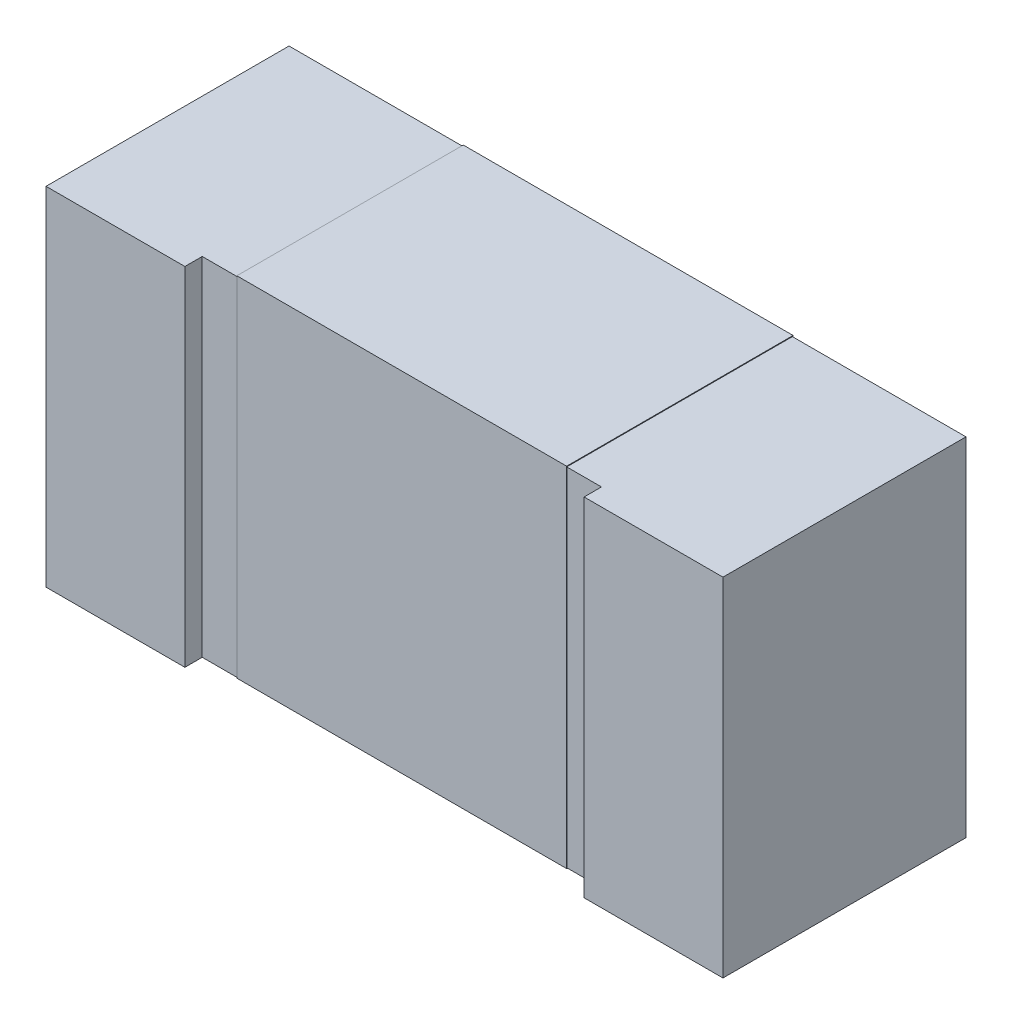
from build123d import *

# Parameters (mm, degrees)
BOSS_EXTRUDE1_DEPTH   = 0.254
BOSS_EXTRUDE1_2_DEPTH = 0.254
SKETCH3_W             = 0.9398
SKETCH3_H             = 0.3048
BOSS_EXTRUDE2_DEPTH   = 0.508
SKETCH4_W             = 0.331359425
SKETCH4_H             = 0.51
BOSS_EXTRUDE3_DEPTH   = 0.4826


with BuildPart() as part:
    # Sketch2 → Boss-Extrude1 (new, symmetric)
    with BuildSketch(Plane(origin=(0, 0, 0), x_dir=(0, 0, -1), z_dir=(0, 1, 0))):
        Polygon((0, 0.2413), (-0.0254, 0.2413), (-0.0254, 0.4699), (-0.3302, 0.4699), (-0.3302, 0.2921), (-0.3556, 0.2921), (-0.3556, 0.4953), (0, 0.4953), align=None)
    extrude(amount=BOSS_EXTRUDE1_DEPTH, both=True)



with BuildPart() as body_2:
    # Sketch2 → Boss-Extrude1 2 (new, symmetric)
    with BuildSketch(Plane(origin=(0, 0, 0), x_dir=(0, 0, -1), z_dir=(0, 1, 0))):
        Polygon((0, -0.4953), (0, -0.2413), (-0.0254, -0.2413), (-0.0254, -0.4699), (-0.3302, -0.4699), (-0.3302, -0.2921), (-0.3556, -0.2921), (-0.3556, -0.4953), align=None)
    extrude(amount=BOSS_EXTRUDE1_2_DEPTH, both=True)


with BuildPart() as part_1:
    add(part.part)

    add(body_2.part)  # Boss-Extrude2 merges body 2
    # Sketch3 → Boss-Extrude2 (add)
    with BuildSketch(Plane(origin=(0, 0.254, 0), x_dir=(1, 0, 0), z_dir=(0, 1, 0))):
        with Locations((0, -0.1778)):
            Rectangle(SKETCH3_W, SKETCH3_H)
    extrude(amount=-BOSS_EXTRUDE2_DEPTH)

    # Sketch4 → Boss-Extrude3 (add)
    with BuildSketch(Plane.ZY.offset(-0.2413)):
        with Locations((0.164679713, 0)):
            Rectangle(SKETCH4_W, SKETCH4_H)
    extrude(amount=BOSS_EXTRUDE3_DEPTH)


solid = part_1.part
